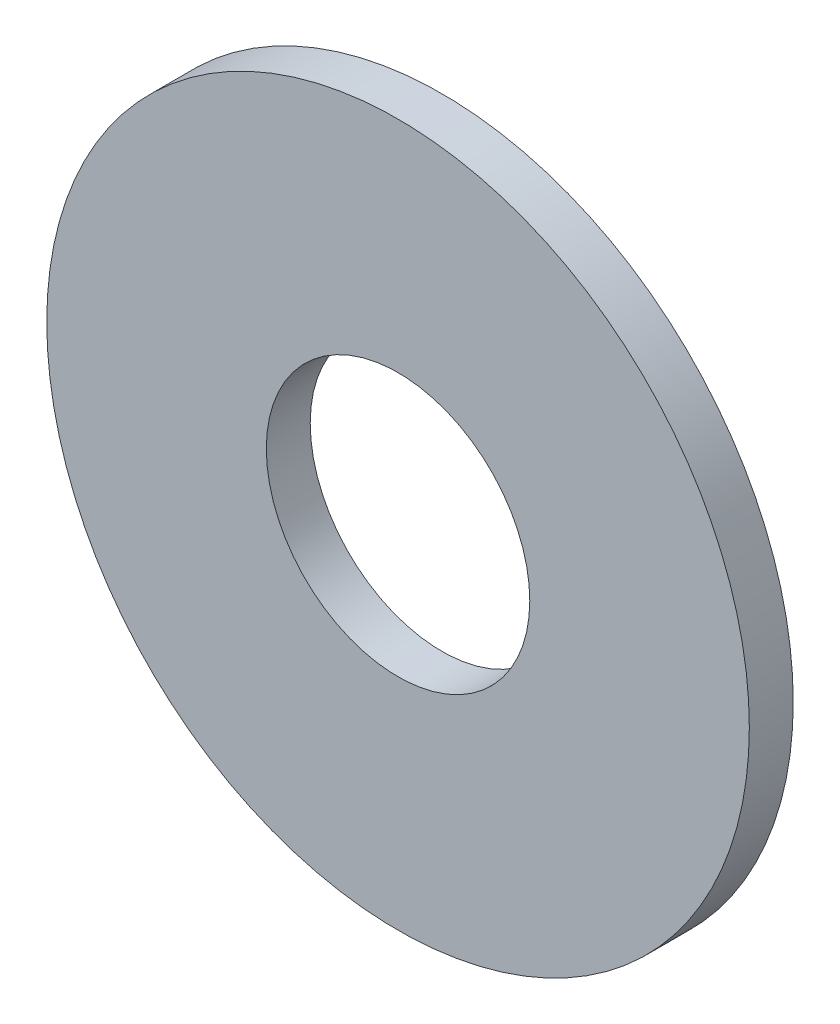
ISO-10303-21;
HEADER;
FILE_DESCRIPTION(('STEP AP214'),'2;1');
FILE_NAME('part.step','',(''),(''),'','','');
FILE_SCHEMA(('AUTOMOTIVE_DESIGN { 1 0 10303 214 1 1 1 1 }'));
ENDSEC;
DATA;
#1=APPLICATION_CONTEXT('core data for automotive mechanical design processes');
#2=APPLICATION_PROTOCOL_DEFINITION('international standard','automotive_design',2000,#1);
#3=PRODUCT_CONTEXT('',#1,'mechanical');
#4=PRODUCT('Part','Part','',(#3));
#5=PRODUCT_RELATED_PRODUCT_CATEGORY('part','',(#4));
#6=PRODUCT_DEFINITION_FORMATION('','',#4);
#7=PRODUCT_DEFINITION_CONTEXT('part definition',#1,'design');
#8=PRODUCT_DEFINITION('design','',#6,#7);
#9=PRODUCT_DEFINITION_SHAPE('','',#8);
#10=(LENGTH_UNIT() NAMED_UNIT(*) SI_UNIT(.MILLI.,.METRE.));
#11=(NAMED_UNIT(*) PLANE_ANGLE_UNIT() SI_UNIT($,.RADIAN.));
#12=(NAMED_UNIT(*) SI_UNIT($,.STERADIAN.) SOLID_ANGLE_UNIT());
#13=UNCERTAINTY_MEASURE_WITH_UNIT(LENGTH_MEASURE(1.E-05),#10,'distance_accuracy_value','');
#14=(GEOMETRIC_REPRESENTATION_CONTEXT(3) GLOBAL_UNCERTAINTY_ASSIGNED_CONTEXT((#13)) GLOBAL_UNIT_ASSIGNED_CONTEXT((#10,
#11,#12)) REPRESENTATION_CONTEXT('',''));
#15=CARTESIAN_POINT('',(0.,0.,0.));
#16=DIRECTION('',(0.,0.,1.));
#17=DIRECTION('',(1.,0.,0.));
#18=AXIS2_PLACEMENT_3D('',#15,#16,#17);
#19=CARTESIAN_POINT('',(0.,0.,0.25));
#20=DIRECTION('',(0.,0.,-1.));
#21=DIRECTION('',(-1.,0.,0.));
#22=AXIS2_PLACEMENT_3D('',#19,#20,#21);
#23=PLANE('',#22);
#24=CARTESIAN_POINT('',(0.,0.,0.25));
#25=DIRECTION('',(0.,0.,1.));
#26=DIRECTION('',(1.,0.,0.));
#27=AXIS2_PLACEMENT_3D('',#24,#25,#26);
#28=CIRCLE('',#27,1.5);
#29=CARTESIAN_POINT('',(1.5,0.,0.25));
#30=VERTEX_POINT('',#29);
#31=EDGE_CURVE('E27',#30,#30,#28,.F.);
#32=ORIENTED_EDGE('',*,*,#31,.T.);
#33=EDGE_LOOP('',(#32));
#34=FACE_BOUND('',#33,.T.);
#35=CARTESIAN_POINT('',(0.,0.,0.25));
#36=DIRECTION('',(0.,0.,1.));
#37=DIRECTION('',(1.,0.,0.));
#38=AXIS2_PLACEMENT_3D('',#35,#36,#37);
#39=CIRCLE('',#38,4.);
#40=CARTESIAN_POINT('',(4.,0.,0.25));
#41=VERTEX_POINT('',#40);
#42=EDGE_CURVE('E18',#41,#41,#39,.F.);
#43=ORIENTED_EDGE('',*,*,#42,.F.);
#44=EDGE_LOOP('',(#43));
#45=FACE_BOUND('',#44,.T.);
#46=ADVANCED_FACE('F14',(#34,#45),#23,.F.);
#47=CARTESIAN_POINT('',(0.,0.,0.));
#48=DIRECTION('',(0.,0.,1.));
#49=DIRECTION('',(1.,0.,0.));
#50=AXIS2_PLACEMENT_3D('',#47,#48,#49);
#51=CYLINDRICAL_SURFACE('',#50,4.);
#52=ORIENTED_EDGE('',*,*,#42,.T.);
#53=EDGE_LOOP('',(#52));
#54=FACE_BOUND('',#53,.T.);
#55=CARTESIAN_POINT('',(0.,0.,-0.25));
#56=DIRECTION('',(0.,0.,1.));
#57=DIRECTION('',(1.,0.,0.));
#58=AXIS2_PLACEMENT_3D('',#55,#56,#57);
#59=CIRCLE('',#58,4.);
#60=CARTESIAN_POINT('',(4.,0.,-0.25));
#61=VERTEX_POINT('',#60);
#62=EDGE_CURVE('E22',#61,#61,#59,.F.);
#63=ORIENTED_EDGE('',*,*,#62,.F.);
#64=EDGE_LOOP('',(#63));
#65=FACE_BOUND('',#64,.T.);
#66=ADVANCED_FACE('F35',(#54,#65),#51,.T.);
#67=CARTESIAN_POINT('',(0.,0.,0.));
#68=DIRECTION('',(0.,0.,1.));
#69=DIRECTION('',(1.,0.,0.));
#70=AXIS2_PLACEMENT_3D('',#67,#68,#69);
#71=CYLINDRICAL_SURFACE('',#70,1.5);
#72=ORIENTED_EDGE('',*,*,#31,.F.);
#73=EDGE_LOOP('',(#72));
#74=FACE_BOUND('',#73,.T.);
#75=CARTESIAN_POINT('',(0.,0.,-0.25));
#76=DIRECTION('',(0.,0.,1.));
#77=DIRECTION('',(1.,0.,0.));
#78=AXIS2_PLACEMENT_3D('',#75,#76,#77);
#79=CIRCLE('',#78,1.5);
#80=CARTESIAN_POINT('',(1.5,0.,-0.25));
#81=VERTEX_POINT('',#80);
#82=EDGE_CURVE('E10',#81,#81,#79,.T.);
#83=ORIENTED_EDGE('',*,*,#82,.F.);
#84=EDGE_LOOP('',(#83));
#85=FACE_BOUND('',#84,.T.);
#86=ADVANCED_FACE('F44',(#74,#85),#71,.F.);
#87=CARTESIAN_POINT('',(0.,0.,-0.25));
#88=DIRECTION('',(0.,0.,-1.));
#89=DIRECTION('',(-1.,0.,0.));
#90=AXIS2_PLACEMENT_3D('',#87,#88,#89);
#91=PLANE('',#90);
#92=ORIENTED_EDGE('',*,*,#82,.T.);
#93=EDGE_LOOP('',(#92));
#94=FACE_BOUND('',#93,.T.);
#95=ORIENTED_EDGE('',*,*,#62,.T.);
#96=EDGE_LOOP('',(#95));
#97=FACE_BOUND('',#96,.T.);
#98=ADVANCED_FACE('F16',(#94,#97),#91,.T.);
#99=CLOSED_SHELL('',(#46,#66,#86,#98));
#100=MANIFOLD_SOLID_BREP('B1',#99);
#101=ADVANCED_BREP_SHAPE_REPRESENTATION('',(#18,#100),#14);
#102=SHAPE_DEFINITION_REPRESENTATION(#9,#101);
ENDSEC;
END-ISO-10303-21;
